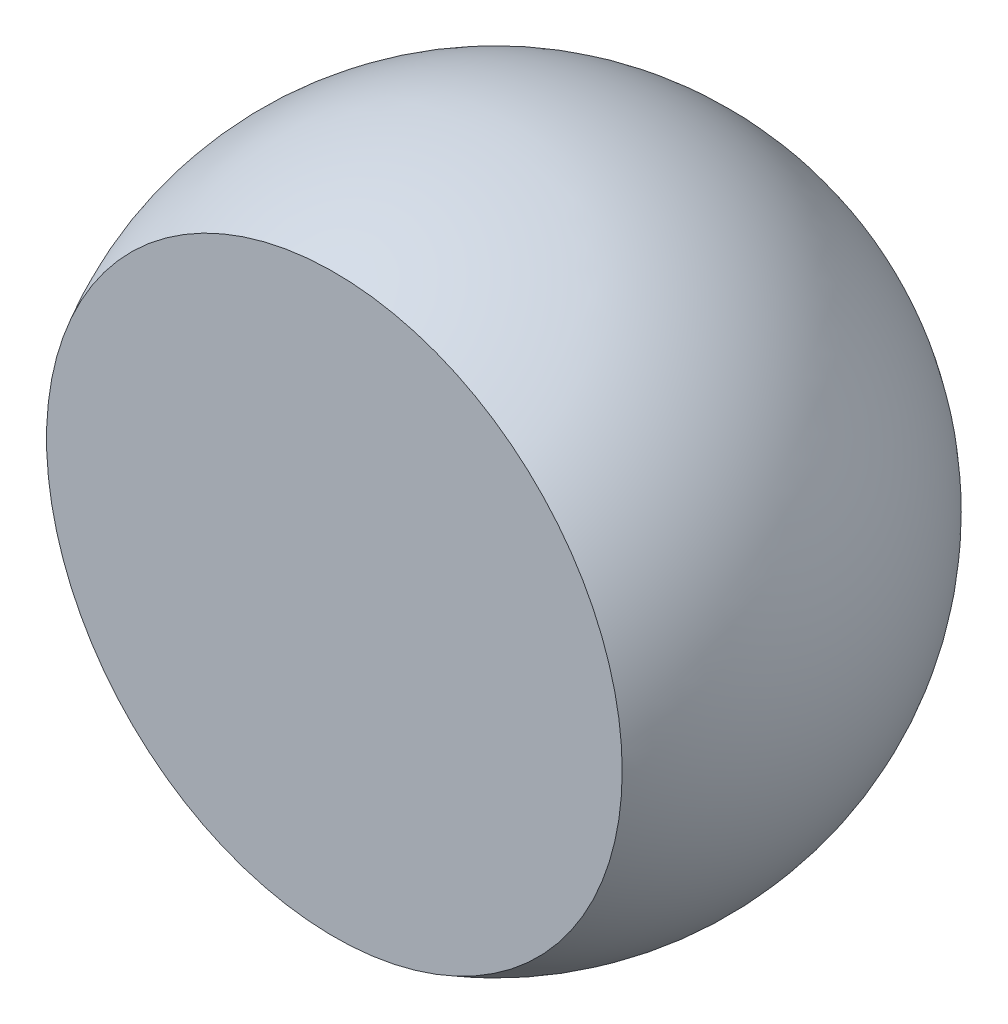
from build123d import *
from build123d.topology import SkipClean

# Parameters (mm, degrees)
CUT_EXTRUDE_1_DEPTH      = 87.602540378
CUT_EXTRUDE_1_DEPTH_BACK = 87.602540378


with BuildPart() as part:
    # Sketch 1 → Revolve 3 (revolve)
    with BuildSketch(Plane(origin=(0, 0, 0), x_dir=(1, 0, 0), z_dir=(0, 1, 0))):
        with BuildLine():
            Line((-50, 0), (50, 0))
            ThreePointArc((50, 0), (0, 50), (-50, 0))
        make_face()
    revolve(axis=Axis((-50, 0, 0), (1, 0, 0)))

    # Sketch 2 → Cut-Extrude 1 (cut, two sides: drawn at the far end of the back side and taken through both)
    with SkipClean():  # the faces are left unmerged after this step: merging them gives an invalid solid
        with BuildSketch(Plane(origin=(0, 0, 0), x_dir=(1, 0, 0), z_dir=(0, 1, 0)).offset(-CUT_EXTRUDE_1_DEPTH_BACK)):
            with BuildLine():
                Line((-43.657787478, -24.372065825), (43.657787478, -24.372065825))
                ThreePointArc((43.657787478, -24.372065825), (0, -50), (-43.657787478, -24.372065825))
            make_face()
        extrude(amount=CUT_EXTRUDE_1_DEPTH + CUT_EXTRUDE_1_DEPTH_BACK, mode=Mode.SUBTRACT)


solid = part.part
